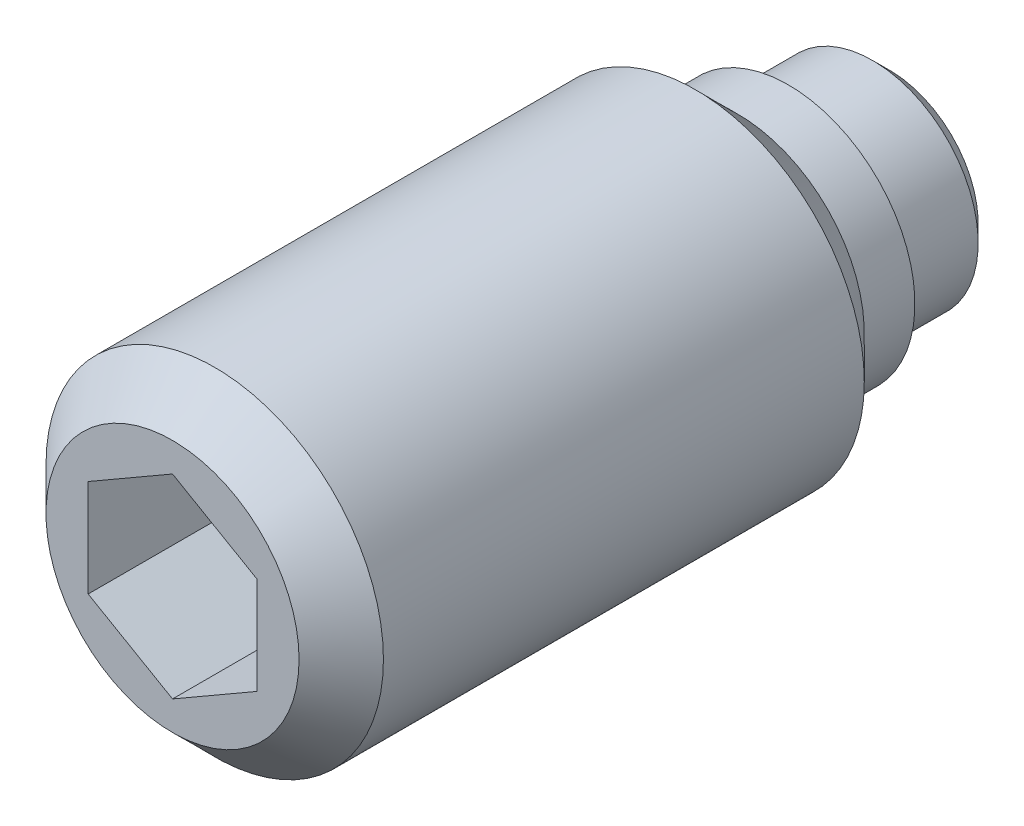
ISO-10303-21;
HEADER;
FILE_DESCRIPTION(('STEP AP214'),'2;1');
FILE_NAME('part.step','',(''),(''),'','','');
FILE_SCHEMA(('AUTOMOTIVE_DESIGN { 1 0 10303 214 1 1 1 1 }'));
ENDSEC;
DATA;
#1=APPLICATION_CONTEXT('core data for automotive mechanical design processes');
#2=APPLICATION_PROTOCOL_DEFINITION('international standard','automotive_design',2000,#1);
#3=PRODUCT_CONTEXT('',#1,'mechanical');
#4=PRODUCT('Part','Part','',(#3));
#5=PRODUCT_RELATED_PRODUCT_CATEGORY('part','',(#4));
#6=PRODUCT_DEFINITION_FORMATION('','',#4);
#7=PRODUCT_DEFINITION_CONTEXT('part definition',#1,'design');
#8=PRODUCT_DEFINITION('design','',#6,#7);
#9=PRODUCT_DEFINITION_SHAPE('','',#8);
#10=(LENGTH_UNIT() NAMED_UNIT(*) SI_UNIT(.MILLI.,.METRE.));
#11=(NAMED_UNIT(*) PLANE_ANGLE_UNIT() SI_UNIT($,.RADIAN.));
#12=(NAMED_UNIT(*) SI_UNIT($,.STERADIAN.) SOLID_ANGLE_UNIT());
#13=UNCERTAINTY_MEASURE_WITH_UNIT(LENGTH_MEASURE(1.E-05),#10,'distance_accuracy_value','');
#14=(GEOMETRIC_REPRESENTATION_CONTEXT(3) GLOBAL_UNCERTAINTY_ASSIGNED_CONTEXT((#13)) GLOBAL_UNIT_ASSIGNED_CONTEXT((#10,
#11,#12)) REPRESENTATION_CONTEXT('',''));
#15=CARTESIAN_POINT('',(0.,0.,0.));
#16=DIRECTION('',(0.,0.,1.));
#17=DIRECTION('',(1.,0.,0.));
#18=AXIS2_PLACEMENT_3D('',#15,#16,#17);
#19=CARTESIAN_POINT('',(0.,0.,1.2));
#20=DIRECTION('',(0.,0.,-1.));
#21=DIRECTION('',(-1.,0.,0.));
#22=AXIS2_PLACEMENT_3D('',#19,#20,#21);
#23=CYLINDRICAL_SURFACE('',#22,2.);
#24=CARTESIAN_POINT('',(0.,0.,8.));
#25=DIRECTION('',(0.,0.,1.));
#26=DIRECTION('',(1.,0.,0.));
#27=AXIS2_PLACEMENT_3D('',#24,#25,#26);
#28=CIRCLE('',#27,2.);
#29=CARTESIAN_POINT('',(2.,0.,8.));
#30=VERTEX_POINT('',#29);
#31=EDGE_CURVE('E9',#30,#30,#28,.F.);
#32=ORIENTED_EDGE('',*,*,#31,.T.);
#33=EDGE_LOOP('',(#32));
#34=FACE_BOUND('',#33,.T.);
#35=CARTESIAN_POINT('',(0.,0.,2.3));
#36=DIRECTION('',(0.,0.,-1.));
#37=DIRECTION('',(-1.,0.,0.));
#38=AXIS2_PLACEMENT_3D('',#35,#36,#37);
#39=CIRCLE('',#38,2.);
#40=CARTESIAN_POINT('',(-2.,0.,2.3));
#41=VERTEX_POINT('',#40);
#42=EDGE_CURVE('E136',#41,#41,#39,.T.);
#43=ORIENTED_EDGE('',*,*,#42,.F.);
#44=EDGE_LOOP('',(#43));
#45=FACE_BOUND('',#44,.T.);
#46=ADVANCED_FACE('F14',(#34,#45),#23,.T.);
#47=CARTESIAN_POINT('',(0.,0.,2.3));
#48=DIRECTION('',(0.,0.,1.));
#49=DIRECTION('',(1.,0.,0.));
#50=AXIS2_PLACEMENT_3D('',#47,#48,#49);
#51=CONICAL_SURFACE('',#50,2.,0.785398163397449);
#52=ORIENTED_EDGE('',*,*,#42,.T.);
#53=EDGE_LOOP('',(#52));
#54=FACE_BOUND('',#53,.T.);
#55=CARTESIAN_POINT('',(0.,0.,1.8));
#56=DIRECTION('',(0.,0.,-1.));
#57=DIRECTION('',(-1.,0.,0.));
#58=AXIS2_PLACEMENT_3D('',#55,#56,#57);
#59=CIRCLE('',#58,1.5);
#60=CARTESIAN_POINT('',(-1.5,0.,1.8));
#61=VERTEX_POINT('',#60);
#62=EDGE_CURVE('E133',#61,#61,#59,.T.);
#63=ORIENTED_EDGE('',*,*,#62,.F.);
#64=EDGE_LOOP('',(#63));
#65=FACE_BOUND('',#64,.T.);
#66=ADVANCED_FACE('F158',(#54,#65),#51,.T.);
#67=CARTESIAN_POINT('',(0.,0.,1.2));
#68=DIRECTION('',(0.,0.,-1.));
#69=DIRECTION('',(-1.,0.,0.));
#70=AXIS2_PLACEMENT_3D('',#67,#68,#69);
#71=CYLINDRICAL_SURFACE('',#70,1.5);
#72=CARTESIAN_POINT('',(0.,0.,1.2));
#73=DIRECTION('',(0.,0.,-1.));
#74=DIRECTION('',(-1.,0.,0.));
#75=AXIS2_PLACEMENT_3D('',#72,#73,#74);
#76=CIRCLE('',#75,1.5);
#77=CARTESIAN_POINT('',(-1.5,0.,1.2));
#78=VERTEX_POINT('',#77);
#79=EDGE_CURVE('E130',#78,#78,#76,.T.);
#80=ORIENTED_EDGE('',*,*,#79,.F.);
#81=EDGE_LOOP('',(#80));
#82=FACE_BOUND('',#81,.T.);
#83=ORIENTED_EDGE('',*,*,#62,.T.);
#84=EDGE_LOOP('',(#83));
#85=FACE_BOUND('',#84,.T.);
#86=ADVANCED_FACE('F163',(#82,#85),#71,.T.);
#87=CARTESIAN_POINT('',(0.,1.5,1.2));
#88=DIRECTION('',(0.,0.,1.));
#89=DIRECTION('',(1.,0.,0.));
#90=AXIS2_PLACEMENT_3D('',#87,#88,#89);
#91=PLANE('',#90);
#92=CARTESIAN_POINT('',(0.,0.,1.2));
#93=DIRECTION('',(0.,0.,-1.));
#94=DIRECTION('',(-1.,0.,0.));
#95=AXIS2_PLACEMENT_3D('',#92,#93,#94);
#96=CIRCLE('',#95,1.25);
#97=CARTESIAN_POINT('',(-1.25,0.,1.2));
#98=VERTEX_POINT('',#97);
#99=EDGE_CURVE('E127',#98,#98,#96,.T.);
#100=ORIENTED_EDGE('',*,*,#99,.F.);
#101=EDGE_LOOP('',(#100));
#102=FACE_BOUND('',#101,.T.);
#103=ORIENTED_EDGE('',*,*,#79,.T.);
#104=EDGE_LOOP('',(#103));
#105=FACE_BOUND('',#104,.T.);
#106=ADVANCED_FACE('F170',(#102,#105),#91,.F.);
#107=CARTESIAN_POINT('',(0.,0.,0.));
#108=DIRECTION('',(0.,0.,-1.));
#109=DIRECTION('',(-1.,0.,0.));
#110=AXIS2_PLACEMENT_3D('',#107,#108,#109);
#111=CYLINDRICAL_SURFACE('',#110,1.25);
#112=CARTESIAN_POINT('',(0.,0.,0.2));
#113=DIRECTION('',(0.,0.,-1.));
#114=DIRECTION('',(-1.,0.,0.));
#115=AXIS2_PLACEMENT_3D('',#112,#113,#114);
#116=CIRCLE('',#115,1.25);
#117=CARTESIAN_POINT('',(-1.25,0.,0.2));
#118=VERTEX_POINT('',#117);
#119=EDGE_CURVE('E124',#118,#118,#116,.T.);
#120=ORIENTED_EDGE('',*,*,#119,.F.);
#121=EDGE_LOOP('',(#120));
#122=FACE_BOUND('',#121,.T.);
#123=ORIENTED_EDGE('',*,*,#99,.T.);
#124=EDGE_LOOP('',(#123));
#125=FACE_BOUND('',#124,.T.);
#126=ADVANCED_FACE('F174',(#122,#125),#111,.T.);
#127=CARTESIAN_POINT('',(0.,0.,0.2));
#128=DIRECTION('',(0.,0.,1.));
#129=DIRECTION('',(1.,0.,0.));
#130=AXIS2_PLACEMENT_3D('',#127,#128,#129);
#131=CONICAL_SURFACE('',#130,1.25,0.785398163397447);
#132=CARTESIAN_POINT('',(0.,0.,0.));
#133=DIRECTION('',(0.,0.,-1.));
#134=DIRECTION('',(-1.,0.,0.));
#135=AXIS2_PLACEMENT_3D('',#132,#133,#134);
#136=CIRCLE('',#135,1.05);
#137=CARTESIAN_POINT('',(-1.05,0.,0.));
#138=VERTEX_POINT('',#137);
#139=EDGE_CURVE('E116',#138,#138,#136,.T.);
#140=ORIENTED_EDGE('',*,*,#139,.F.);
#141=EDGE_LOOP('',(#140));
#142=FACE_BOUND('',#141,.T.);
#143=ORIENTED_EDGE('',*,*,#119,.T.);
#144=EDGE_LOOP('',(#143));
#145=FACE_BOUND('',#144,.T.);
#146=ADVANCED_FACE('F178',(#142,#145),#131,.T.);
#147=CARTESIAN_POINT('',(0.,1.05,0.));
#148=DIRECTION('',(0.,0.,1.));
#149=DIRECTION('',(1.,0.,0.));
#150=AXIS2_PLACEMENT_3D('',#147,#148,#149);
#151=PLANE('',#150);
#152=ORIENTED_EDGE('',*,*,#139,.T.);
#153=EDGE_LOOP('',(#152));
#154=FACE_BOUND('',#153,.T.);
#155=ADVANCED_FACE('F153',(#154),#151,.F.);
#156=CARTESIAN_POINT('',(0.,0.,8.5));
#157=DIRECTION('',(0.,0.,1.));
#158=DIRECTION('',(1.,0.,0.));
#159=AXIS2_PLACEMENT_3D('',#156,#157,#158);
#160=PLANE('',#159);
#161=DIRECTION('',(0.866025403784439,-0.5,0.));
#162=VECTOR('',#161,1.);
#163=CARTESIAN_POINT('',(-1.,-0.577350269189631,8.5));
#164=LINE('',#163,#162);
#165=CARTESIAN_POINT('',(-1.,-0.577350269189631,8.5));
#166=VERTEX_POINT('',#165);
#167=CARTESIAN_POINT('',(0.,-1.15470053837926,8.5));
#168=VERTEX_POINT('',#167);
#169=EDGE_CURVE('E29',#166,#168,#164,.T.);
#170=ORIENTED_EDGE('',*,*,#169,.F.);
#171=DIRECTION('',(0.,-1.,0.));
#172=VECTOR('',#171,1.);
#173=CARTESIAN_POINT('',(-1.,0.577350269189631,8.5));
#174=LINE('',#173,#172);
#175=CARTESIAN_POINT('',(-1.,0.577350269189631,8.5));
#176=VERTEX_POINT('',#175);
#177=EDGE_CURVE('E112',#176,#166,#174,.T.);
#178=ORIENTED_EDGE('',*,*,#177,.F.);
#179=DIRECTION('',(-0.866025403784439,-0.5,0.));
#180=VECTOR('',#179,1.);
#181=CARTESIAN_POINT('',(0.,1.15470053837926,8.5));
#182=LINE('',#181,#180);
#183=CARTESIAN_POINT('',(0.,1.15470053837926,8.5));
#184=VERTEX_POINT('',#183);
#185=EDGE_CURVE('E110',#184,#176,#182,.T.);
#186=ORIENTED_EDGE('',*,*,#185,.F.);
#187=DIRECTION('',(-0.866025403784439,0.5,0.));
#188=VECTOR('',#187,1.);
#189=CARTESIAN_POINT('',(1.,0.577350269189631,8.5));
#190=LINE('',#189,#188);
#191=CARTESIAN_POINT('',(1.,0.577350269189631,8.5));
#192=VERTEX_POINT('',#191);
#193=EDGE_CURVE('E77',#192,#184,#190,.T.);
#194=ORIENTED_EDGE('',*,*,#193,.F.);
#195=DIRECTION('',(0.,1.,0.));
#196=VECTOR('',#195,1.);
#197=CARTESIAN_POINT('',(1.,-0.577350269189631,8.5));
#198=LINE('',#197,#196);
#199=CARTESIAN_POINT('',(1.,-0.577350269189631,8.5));
#200=VERTEX_POINT('',#199);
#201=EDGE_CURVE('E106',#200,#192,#198,.T.);
#202=ORIENTED_EDGE('',*,*,#201,.F.);
#203=DIRECTION('',(0.866025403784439,0.5,0.));
#204=VECTOR('',#203,1.);
#205=CARTESIAN_POINT('',(0.,-1.15470053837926,8.5));
#206=LINE('',#205,#204);
#207=EDGE_CURVE('E103',#168,#200,#206,.T.);
#208=ORIENTED_EDGE('',*,*,#207,.F.);
#209=EDGE_LOOP('',(#170,#178,#186,#194,#202,#208));
#210=FACE_BOUND('',#209,.T.);
#211=CARTESIAN_POINT('',(0.,0.,8.5));
#212=DIRECTION('',(0.,0.,1.));
#213=DIRECTION('',(1.,0.,0.));
#214=AXIS2_PLACEMENT_3D('',#211,#212,#213);
#215=CIRCLE('',#214,1.5);
#216=CARTESIAN_POINT('',(1.5,0.,8.5));
#217=VERTEX_POINT('',#216);
#218=EDGE_CURVE('E22',#217,#217,#215,.T.);
#219=ORIENTED_EDGE('',*,*,#218,.T.);
#220=EDGE_LOOP('',(#219));
#221=FACE_BOUND('',#220,.T.);
#222=ADVANCED_FACE('F141',(#210,#221),#160,.T.);
#223=CARTESIAN_POINT('',(0.,0.,8.5));
#224=DIRECTION('',(0.,0.,-1.));
#225=DIRECTION('',(-1.,0.,0.));
#226=AXIS2_PLACEMENT_3D('',#223,#224,#225);
#227=CONICAL_SURFACE('',#226,1.5,0.785398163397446);
#228=ORIENTED_EDGE('',*,*,#31,.F.);
#229=EDGE_LOOP('',(#228));
#230=FACE_BOUND('',#229,.T.);
#231=ORIENTED_EDGE('',*,*,#218,.F.);
#232=EDGE_LOOP('',(#231));
#233=FACE_BOUND('',#232,.T.);
#234=ADVANCED_FACE('F16',(#230,#233),#227,.T.);
#235=CARTESIAN_POINT('',(-1.,-0.577350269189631,6.));
#236=DIRECTION('',(-0.5,-0.866025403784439,0.));
#237=DIRECTION('',(0.866025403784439,-0.5,0.));
#238=AXIS2_PLACEMENT_3D('',#235,#236,#237);
#239=PLANE('',#238);
#240=ORIENTED_EDGE('',*,*,#169,.T.);
#241=DIRECTION('',(0.,0.,1.));
#242=VECTOR('',#241,1.);
#243=CARTESIAN_POINT('',(0.,-1.15470053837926,6.));
#244=LINE('',#243,#242);
#245=CARTESIAN_POINT('',(0.,-1.15470053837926,6.));
#246=VERTEX_POINT('',#245);
#247=EDGE_CURVE('E59',#246,#168,#244,.T.);
#248=ORIENTED_EDGE('',*,*,#247,.F.);
#249=DIRECTION('',(0.866025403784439,-0.5,0.));
#250=VECTOR('',#249,1.);
#251=CARTESIAN_POINT('',(-1.,-0.577350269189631,6.));
#252=LINE('',#251,#250);
#253=CARTESIAN_POINT('',(-1.,-0.577350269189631,6.));
#254=VERTEX_POINT('',#253);
#255=EDGE_CURVE('E114',#254,#246,#252,.T.);
#256=ORIENTED_EDGE('',*,*,#255,.F.);
#257=DIRECTION('',(0.,0.,1.));
#258=VECTOR('',#257,1.);
#259=CARTESIAN_POINT('',(-1.,-0.577350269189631,6.));
#260=LINE('',#259,#258);
#261=EDGE_CURVE('E37',#254,#166,#260,.T.);
#262=ORIENTED_EDGE('',*,*,#261,.T.);
#263=EDGE_LOOP('',(#240,#248,#256,#262));
#264=FACE_BOUND('',#263,.T.);
#265=ADVANCED_FACE('F144',(#264),#239,.F.);
#266=CARTESIAN_POINT('',(-1.,0.577350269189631,6.));
#267=DIRECTION('',(-1.,0.,0.));
#268=DIRECTION('',(0.,0.,1.));
#269=AXIS2_PLACEMENT_3D('',#266,#267,#268);
#270=PLANE('',#269);
#271=ORIENTED_EDGE('',*,*,#177,.T.);
#272=ORIENTED_EDGE('',*,*,#261,.F.);
#273=DIRECTION('',(0.,-1.,0.));
#274=VECTOR('',#273,1.);
#275=CARTESIAN_POINT('',(-1.,0.577350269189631,6.));
#276=LINE('',#275,#274);
#277=CARTESIAN_POINT('',(-1.,0.577350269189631,6.));
#278=VERTEX_POINT('',#277);
#279=EDGE_CURVE('E89',#278,#254,#276,.T.);
#280=ORIENTED_EDGE('',*,*,#279,.F.);
#281=DIRECTION('',(0.,0.,1.));
#282=VECTOR('',#281,1.);
#283=CARTESIAN_POINT('',(-1.,0.577350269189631,6.));
#284=LINE('',#283,#282);
#285=EDGE_CURVE('E81',#278,#176,#284,.T.);
#286=ORIENTED_EDGE('',*,*,#285,.T.);
#287=EDGE_LOOP('',(#271,#272,#280,#286));
#288=FACE_BOUND('',#287,.T.);
#289=ADVANCED_FACE('F151',(#288),#270,.F.);
#290=CARTESIAN_POINT('',(0.,1.15470053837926,6.));
#291=DIRECTION('',(-0.5,0.866025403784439,0.));
#292=DIRECTION('',(-0.866025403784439,-0.5,0.));
#293=AXIS2_PLACEMENT_3D('',#290,#291,#292);
#294=PLANE('',#293);
#295=ORIENTED_EDGE('',*,*,#185,.T.);
#296=ORIENTED_EDGE('',*,*,#285,.F.);
#297=DIRECTION('',(-0.866025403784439,-0.5,0.));
#298=VECTOR('',#297,1.);
#299=CARTESIAN_POINT('',(0.,1.15470053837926,6.));
#300=LINE('',#299,#298);
#301=CARTESIAN_POINT('',(0.,1.15470053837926,6.));
#302=VERTEX_POINT('',#301);
#303=EDGE_CURVE('E85',#302,#278,#300,.T.);
#304=ORIENTED_EDGE('',*,*,#303,.F.);
#305=DIRECTION('',(0.,0.,1.));
#306=VECTOR('',#305,1.);
#307=CARTESIAN_POINT('',(0.,1.15470053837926,6.));
#308=LINE('',#307,#306);
#309=EDGE_CURVE('E70',#302,#184,#308,.T.);
#310=ORIENTED_EDGE('',*,*,#309,.T.);
#311=EDGE_LOOP('',(#295,#296,#304,#310));
#312=FACE_BOUND('',#311,.T.);
#313=ADVANCED_FACE('F86',(#312),#294,.F.);
#314=CARTESIAN_POINT('',(1.,0.577350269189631,6.));
#315=DIRECTION('',(0.5,0.866025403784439,0.));
#316=DIRECTION('',(-0.866025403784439,0.5,0.));
#317=AXIS2_PLACEMENT_3D('',#314,#315,#316);
#318=PLANE('',#317);
#319=ORIENTED_EDGE('',*,*,#193,.T.);
#320=ORIENTED_EDGE('',*,*,#309,.F.);
#321=DIRECTION('',(-0.866025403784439,0.5,0.));
#322=VECTOR('',#321,1.);
#323=CARTESIAN_POINT('',(1.,0.577350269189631,6.));
#324=LINE('',#323,#322);
#325=CARTESIAN_POINT('',(1.,0.577350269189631,6.));
#326=VERTEX_POINT('',#325);
#327=EDGE_CURVE('E74',#326,#302,#324,.T.);
#328=ORIENTED_EDGE('',*,*,#327,.F.);
#329=DIRECTION('',(0.,0.,1.));
#330=VECTOR('',#329,1.);
#331=CARTESIAN_POINT('',(1.,0.577350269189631,6.));
#332=LINE('',#331,#330);
#333=EDGE_CURVE('E82',#326,#192,#332,.T.);
#334=ORIENTED_EDGE('',*,*,#333,.T.);
#335=EDGE_LOOP('',(#319,#320,#328,#334));
#336=FACE_BOUND('',#335,.T.);
#337=ADVANCED_FACE('F72',(#336),#318,.F.);
#338=CARTESIAN_POINT('',(1.,-0.577350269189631,6.));
#339=DIRECTION('',(1.,0.,0.));
#340=DIRECTION('',(0.,0.,-1.));
#341=AXIS2_PLACEMENT_3D('',#338,#339,#340);
#342=PLANE('',#341);
#343=ORIENTED_EDGE('',*,*,#201,.T.);
#344=ORIENTED_EDGE('',*,*,#333,.F.);
#345=DIRECTION('',(0.,1.,0.));
#346=VECTOR('',#345,1.);
#347=CARTESIAN_POINT('',(1.,-0.577350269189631,6.));
#348=LINE('',#347,#346);
#349=CARTESIAN_POINT('',(1.,-0.577350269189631,6.));
#350=VERTEX_POINT('',#349);
#351=EDGE_CURVE('E95',#350,#326,#348,.T.);
#352=ORIENTED_EDGE('',*,*,#351,.F.);
#353=DIRECTION('',(0.,0.,1.));
#354=VECTOR('',#353,1.);
#355=CARTESIAN_POINT('',(1.,-0.577350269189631,6.));
#356=LINE('',#355,#354);
#357=EDGE_CURVE('E119',#350,#200,#356,.T.);
#358=ORIENTED_EDGE('',*,*,#357,.T.);
#359=EDGE_LOOP('',(#343,#344,#352,#358));
#360=FACE_BOUND('',#359,.T.);
#361=ADVANCED_FACE('F189',(#360),#342,.F.);
#362=CARTESIAN_POINT('',(0.,-1.15470053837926,6.));
#363=DIRECTION('',(0.5,-0.866025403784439,0.));
#364=DIRECTION('',(0.866025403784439,0.5,0.));
#365=AXIS2_PLACEMENT_3D('',#362,#363,#364);
#366=PLANE('',#365);
#367=ORIENTED_EDGE('',*,*,#207,.T.);
#368=ORIENTED_EDGE('',*,*,#357,.F.);
#369=DIRECTION('',(0.866025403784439,0.5,0.));
#370=VECTOR('',#369,1.);
#371=CARTESIAN_POINT('',(0.,-1.15470053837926,6.));
#372=LINE('',#371,#370);
#373=EDGE_CURVE('E97',#246,#350,#372,.T.);
#374=ORIENTED_EDGE('',*,*,#373,.F.);
#375=ORIENTED_EDGE('',*,*,#247,.T.);
#376=EDGE_LOOP('',(#367,#368,#374,#375));
#377=FACE_BOUND('',#376,.T.);
#378=ADVANCED_FACE('F186',(#377),#366,.F.);
#379=CARTESIAN_POINT('',(0.,0.,6.));
#380=DIRECTION('',(0.,0.,1.));
#381=DIRECTION('',(1.,0.,0.));
#382=AXIS2_PLACEMENT_3D('',#379,#380,#381);
#383=PLANE('',#382);
#384=ORIENTED_EDGE('',*,*,#255,.T.);
#385=ORIENTED_EDGE('',*,*,#373,.T.);
#386=ORIENTED_EDGE('',*,*,#351,.T.);
#387=ORIENTED_EDGE('',*,*,#327,.T.);
#388=ORIENTED_EDGE('',*,*,#303,.T.);
#389=ORIENTED_EDGE('',*,*,#279,.T.);
#390=EDGE_LOOP('',(#384,#385,#386,#387,#388,#389));
#391=FACE_BOUND('',#390,.T.);
#392=ADVANCED_FACE('F92',(#391),#383,.T.);
#393=CLOSED_SHELL('',(#46,#66,#86,#106,#126,#146,#155,#222,#234,#265,#289,#313,#337,#361,#378,#392));
#394=MANIFOLD_SOLID_BREP('B1',#393);
#395=ADVANCED_BREP_SHAPE_REPRESENTATION('',(#18,#394),#14);
#396=SHAPE_DEFINITION_REPRESENTATION(#9,#395);
ENDSEC;
END-ISO-10303-21;
